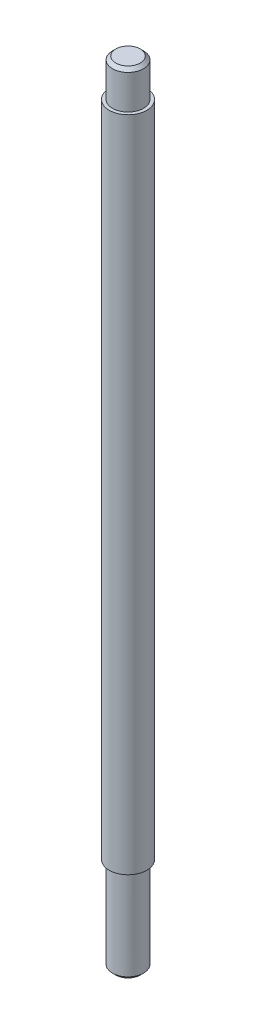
from build123d import *

# Parameters (mm, degrees)
SKETCH1_R      = 2
EXTRUDE1_DEPTH = 84
SKETCH2_R      = 6.024804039
SKETCH2_R_2    = 1.65
EXTRUDE2_DEPTH = 4
EXTRUDE3_START = -10
SKETCH3_R      = 4.046672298
SKETCH3_R_2    = 1.65
EXTRUDE3_DEPTH = 10
CHAMFER1_SIZE  = 0.35


with BuildPart() as part:
    # Sketch1 → Extrude1 (new body)
    with BuildSketch(Plane(origin=(0, 0, 0), x_dir=(1, 0, 0), z_dir=(0, 1, 0))):
        with Locations(Location((0, 0, 0), (0, 0, 90))):
            Circle(SKETCH1_R)
    extrude(amount=EXTRUDE1_DEPTH)

    # Sketch2 → Extrude2 (cut)
    with BuildSketch(Plane(origin=(0, 84, 0), x_dir=(1, 0, 0), z_dir=(0, 1, 0))):
        Circle(SKETCH2_R)
        with Locations(Location((0, 0, 0), (0, 0, 270))):
            Circle(SKETCH2_R_2, mode=Mode.SUBTRACT)
    extrude(amount=-EXTRUDE2_DEPTH, mode=Mode.SUBTRACT)

    # Sketch3 → Extrude3 (cut)
    with BuildSketch(Plane.XZ.offset(EXTRUDE3_START)):
        Circle(SKETCH3_R)
        with Locations(Location((0, 0, 0), (0, 0, 90))):
            Circle(SKETCH3_R_2, mode=Mode.SUBTRACT)
    extrude(amount=EXTRUDE3_DEPTH, mode=Mode.SUBTRACT)

    # Chamfer1
    chamfer1_edges = [part.edges().sort_by_distance(p)[0] for p in [
        (0, 0, -1.65),
        (0, 84, -1.65),
    ]]
    chamfer(chamfer1_edges, length=CHAMFER1_SIZE)


solid = part.part
